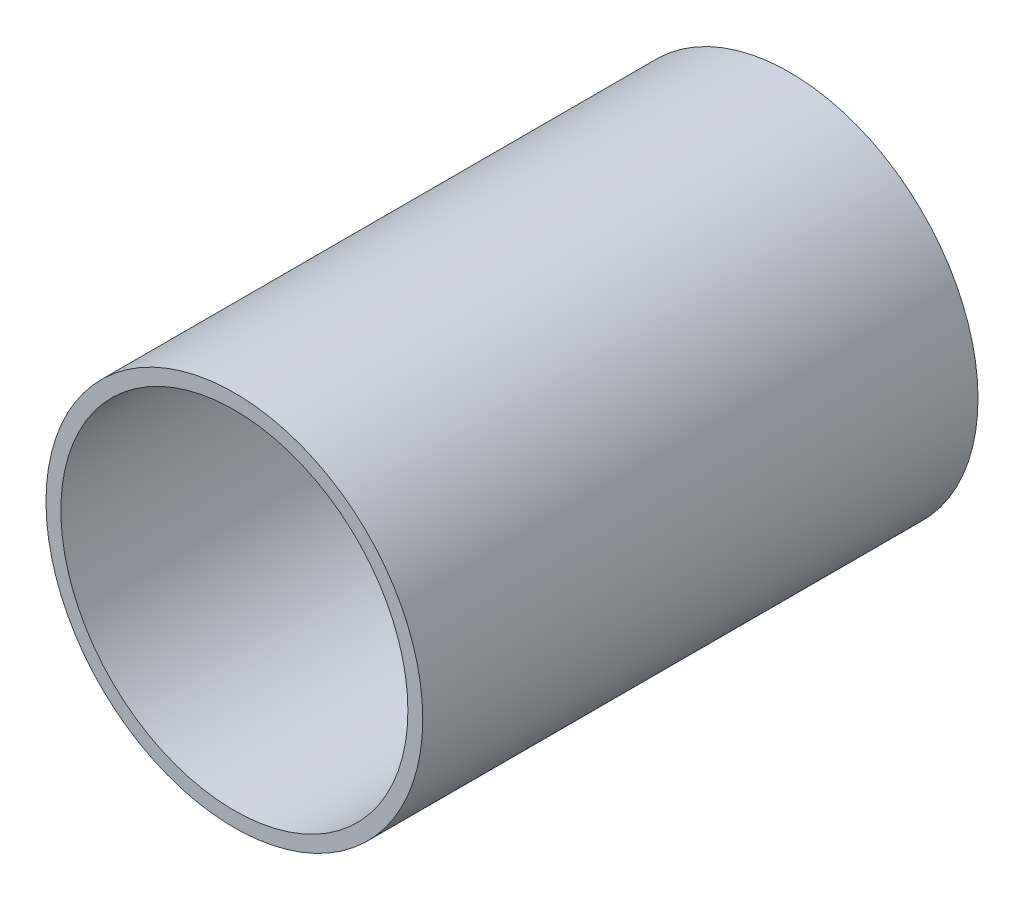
ISO-10303-21;
HEADER;
FILE_DESCRIPTION(('STEP AP214'),'2;1');
FILE_NAME('part.step','',(''),(''),'','','');
FILE_SCHEMA(('AUTOMOTIVE_DESIGN { 1 0 10303 214 1 1 1 1 }'));
ENDSEC;
DATA;
#1=APPLICATION_CONTEXT('core data for automotive mechanical design processes');
#2=APPLICATION_PROTOCOL_DEFINITION('international standard','automotive_design',2000,#1);
#3=PRODUCT_CONTEXT('',#1,'mechanical');
#4=PRODUCT('Part','Part','',(#3));
#5=PRODUCT_RELATED_PRODUCT_CATEGORY('part','',(#4));
#6=PRODUCT_DEFINITION_FORMATION('','',#4);
#7=PRODUCT_DEFINITION_CONTEXT('part definition',#1,'design');
#8=PRODUCT_DEFINITION('design','',#6,#7);
#9=PRODUCT_DEFINITION_SHAPE('','',#8);
#10=(LENGTH_UNIT() NAMED_UNIT(*) SI_UNIT(.MILLI.,.METRE.));
#11=(NAMED_UNIT(*) PLANE_ANGLE_UNIT() SI_UNIT($,.RADIAN.));
#12=(NAMED_UNIT(*) SI_UNIT($,.STERADIAN.) SOLID_ANGLE_UNIT());
#13=UNCERTAINTY_MEASURE_WITH_UNIT(LENGTH_MEASURE(1.E-05),#10,'distance_accuracy_value','');
#14=(GEOMETRIC_REPRESENTATION_CONTEXT(3) GLOBAL_UNCERTAINTY_ASSIGNED_CONTEXT((#13)) GLOBAL_UNIT_ASSIGNED_CONTEXT((#10,
#11,#12)) REPRESENTATION_CONTEXT('',''));
#15=CARTESIAN_POINT('',(0.,0.,0.));
#16=DIRECTION('',(0.,0.,1.));
#17=DIRECTION('',(1.,0.,0.));
#18=AXIS2_PLACEMENT_3D('',#15,#16,#17);
#19=CARTESIAN_POINT('',(0.,0.,-355.6));
#20=DIRECTION('',(0.,0.,1.));
#21=DIRECTION('',(1.,0.,0.));
#22=AXIS2_PLACEMENT_3D('',#19,#20,#21);
#23=CYLINDRICAL_SURFACE('',#22,120.65);
#24=CARTESIAN_POINT('',(0.,0.,-355.6));
#25=DIRECTION('',(0.,0.,1.));
#26=DIRECTION('',(1.,0.,0.));
#27=AXIS2_PLACEMENT_3D('',#24,#25,#26);
#28=CIRCLE('',#27,120.65);
#29=CARTESIAN_POINT('',(120.65,0.,-355.6));
#30=VERTEX_POINT('',#29);
#31=EDGE_CURVE('E10',#30,#30,#28,.T.);
#32=ORIENTED_EDGE('',*,*,#31,.T.);
#33=EDGE_LOOP('',(#32));
#34=FACE_BOUND('',#33,.T.);
#35=CARTESIAN_POINT('',(0.,0.,0.));
#36=DIRECTION('',(0.,0.,1.));
#37=DIRECTION('',(1.,0.,0.));
#38=AXIS2_PLACEMENT_3D('',#35,#36,#37);
#39=CIRCLE('',#38,120.65);
#40=CARTESIAN_POINT('',(120.65,0.,0.));
#41=VERTEX_POINT('',#40);
#42=EDGE_CURVE('E40',#41,#41,#39,.T.);
#43=ORIENTED_EDGE('',*,*,#42,.F.);
#44=EDGE_LOOP('',(#43));
#45=FACE_BOUND('',#44,.T.);
#46=ADVANCED_FACE('F37',(#34,#45),#23,.T.);
#47=CARTESIAN_POINT('',(0.,0.,-355.6));
#48=DIRECTION('',(0.,0.,1.));
#49=DIRECTION('',(1.,0.,0.));
#50=AXIS2_PLACEMENT_3D('',#47,#48,#49);
#51=PLANE('',#50);
#52=CARTESIAN_POINT('',(0.,0.,-355.6));
#53=DIRECTION('',(0.,0.,1.));
#54=DIRECTION('',(1.,0.,0.));
#55=AXIS2_PLACEMENT_3D('',#52,#53,#54);
#56=CIRCLE('',#55,111.125);
#57=CARTESIAN_POINT('',(111.125,0.,-355.6));
#58=VERTEX_POINT('',#57);
#59=EDGE_CURVE('E49',#58,#58,#56,.T.);
#60=ORIENTED_EDGE('',*,*,#59,.T.);
#61=EDGE_LOOP('',(#60));
#62=FACE_BOUND('',#61,.T.);
#63=ORIENTED_EDGE('',*,*,#31,.F.);
#64=EDGE_LOOP('',(#63));
#65=FACE_BOUND('',#64,.T.);
#66=ADVANCED_FACE('F59',(#62,#65),#51,.F.);
#67=CARTESIAN_POINT('',(0.,0.,0.));
#68=DIRECTION('',(0.,0.,1.));
#69=DIRECTION('',(1.,0.,0.));
#70=AXIS2_PLACEMENT_3D('',#67,#68,#69);
#71=PLANE('',#70);
#72=CARTESIAN_POINT('',(0.,0.,0.));
#73=DIRECTION('',(0.,0.,1.));
#74=DIRECTION('',(1.,0.,0.));
#75=AXIS2_PLACEMENT_3D('',#72,#73,#74);
#76=CIRCLE('',#75,111.125);
#77=CARTESIAN_POINT('',(111.125,0.,0.));
#78=VERTEX_POINT('',#77);
#79=EDGE_CURVE('E51',#78,#78,#76,.T.);
#80=ORIENTED_EDGE('',*,*,#79,.F.);
#81=EDGE_LOOP('',(#80));
#82=FACE_BOUND('',#81,.T.);
#83=ORIENTED_EDGE('',*,*,#42,.T.);
#84=EDGE_LOOP('',(#83));
#85=FACE_BOUND('',#84,.T.);
#86=ADVANCED_FACE('F65',(#82,#85),#71,.T.);
#87=CARTESIAN_POINT('',(0.,0.,-355.6));
#88=DIRECTION('',(0.,0.,1.));
#89=DIRECTION('',(1.,0.,0.));
#90=AXIS2_PLACEMENT_3D('',#87,#88,#89);
#91=CYLINDRICAL_SURFACE('',#90,111.125);
#92=ORIENTED_EDGE('',*,*,#59,.F.);
#93=EDGE_LOOP('',(#92));
#94=FACE_BOUND('',#93,.T.);
#95=ORIENTED_EDGE('',*,*,#79,.T.);
#96=EDGE_LOOP('',(#95));
#97=FACE_BOUND('',#96,.T.);
#98=ADVANCED_FACE('F62',(#94,#97),#91,.F.);
#99=CLOSED_SHELL('',(#46,#66,#86,#98));
#100=MANIFOLD_SOLID_BREP('B2',#99);
#101=ADVANCED_BREP_SHAPE_REPRESENTATION('',(#18,#100),#14);
#102=SHAPE_DEFINITION_REPRESENTATION(#9,#101);
ENDSEC;
END-ISO-10303-21;
